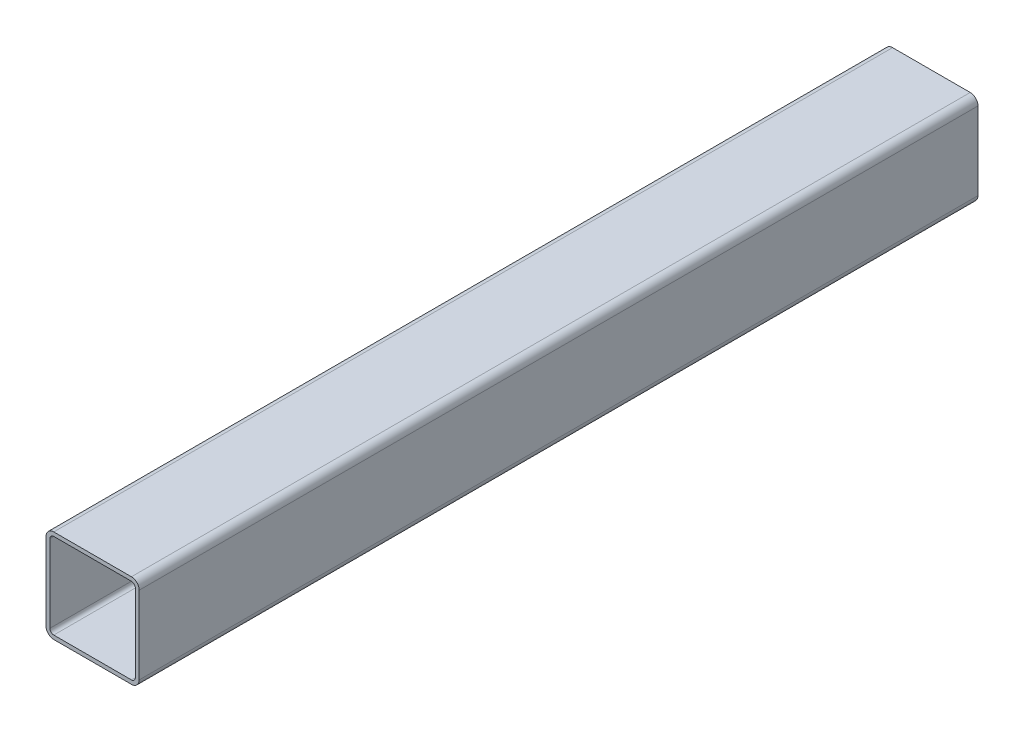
ISO-10303-21;
HEADER;
FILE_DESCRIPTION(('STEP AP214'),'2;1');
FILE_NAME('part.step','',(''),(''),'','','');
FILE_SCHEMA(('AUTOMOTIVE_DESIGN { 1 0 10303 214 1 1 1 1 }'));
ENDSEC;
DATA;
#1=APPLICATION_CONTEXT('core data for automotive mechanical design processes');
#2=APPLICATION_PROTOCOL_DEFINITION('international standard','automotive_design',2000,#1);
#3=PRODUCT_CONTEXT('',#1,'mechanical');
#4=PRODUCT('Part','Part','',(#3));
#5=PRODUCT_RELATED_PRODUCT_CATEGORY('part','',(#4));
#6=PRODUCT_DEFINITION_FORMATION('','',#4);
#7=PRODUCT_DEFINITION_CONTEXT('part definition',#1,'design');
#8=PRODUCT_DEFINITION('design','',#6,#7);
#9=PRODUCT_DEFINITION_SHAPE('','',#8);
#10=(LENGTH_UNIT() NAMED_UNIT(*) SI_UNIT(.MILLI.,.METRE.));
#11=(NAMED_UNIT(*) PLANE_ANGLE_UNIT() SI_UNIT($,.RADIAN.));
#12=(NAMED_UNIT(*) SI_UNIT($,.STERADIAN.) SOLID_ANGLE_UNIT());
#13=UNCERTAINTY_MEASURE_WITH_UNIT(LENGTH_MEASURE(1.E-05),#10,'distance_accuracy_value','');
#14=(GEOMETRIC_REPRESENTATION_CONTEXT(3) GLOBAL_UNCERTAINTY_ASSIGNED_CONTEXT((#13)) GLOBAL_UNIT_ASSIGNED_CONTEXT((#10,
#11,#12)) REPRESENTATION_CONTEXT('',''));
#15=CARTESIAN_POINT('',(0.,0.,0.));
#16=DIRECTION('',(0.,0.,1.));
#17=DIRECTION('',(1.,0.,0.));
#18=AXIS2_PLACEMENT_3D('',#15,#16,#17);
#19=CARTESIAN_POINT('',(-63.5,63.5,-1219.2));
#20=DIRECTION('',(0.,0.,1.));
#21=DIRECTION('',(1.,0.,0.));
#22=AXIS2_PLACEMENT_3D('',#19,#20,#21);
#23=CYLINDRICAL_SURFACE('',#22,12.7);
#24=DIRECTION('',(0.,0.,1.));
#25=VECTOR('',#24,1.);
#26=CARTESIAN_POINT('',(-76.2,63.5,-1219.2));
#27=LINE('',#26,#25);
#28=CARTESIAN_POINT('',(-76.2,63.5,-1219.2));
#29=VERTEX_POINT('',#28);
#30=CARTESIAN_POINT('',(-76.2,63.5,152.4));
#31=VERTEX_POINT('',#30);
#32=EDGE_CURVE('E48',#29,#31,#27,.T.);
#33=ORIENTED_EDGE('',*,*,#32,.T.);
#34=CARTESIAN_POINT('',(-63.5,63.5,152.4));
#35=DIRECTION('',(0.,0.,1.));
#36=DIRECTION('',(1.,0.,0.));
#37=AXIS2_PLACEMENT_3D('',#34,#35,#36);
#38=CIRCLE('',#37,12.7);
#39=CARTESIAN_POINT('',(-63.5,76.2,152.4));
#40=VERTEX_POINT('',#39);
#41=EDGE_CURVE('E211',#40,#31,#38,.T.);
#42=ORIENTED_EDGE('',*,*,#41,.F.);
#43=DIRECTION('',(0.,0.,1.));
#44=VECTOR('',#43,1.);
#45=CARTESIAN_POINT('',(-63.5,76.2,-1219.2));
#46=LINE('',#45,#44);
#47=CARTESIAN_POINT('',(-63.5,76.2,-1219.2));
#48=VERTEX_POINT('',#47);
#49=EDGE_CURVE('E11',#48,#40,#46,.T.);
#50=ORIENTED_EDGE('',*,*,#49,.F.);
#51=CARTESIAN_POINT('',(-63.5,63.5,-1219.2));
#52=DIRECTION('',(0.,0.,1.));
#53=DIRECTION('',(1.,0.,0.));
#54=AXIS2_PLACEMENT_3D('',#51,#52,#53);
#55=CIRCLE('',#54,12.7);
#56=EDGE_CURVE('E271',#48,#29,#55,.T.);
#57=ORIENTED_EDGE('',*,*,#56,.T.);
#58=EDGE_LOOP('',(#33,#42,#50,#57));
#59=FACE_BOUND('',#58,.T.);
#60=ADVANCED_FACE('F45',(#59),#23,.T.);
#61=CARTESIAN_POINT('',(-63.5,76.2,-1219.2));
#62=DIRECTION('',(0.,1.,0.));
#63=DIRECTION('',(0.,0.,1.));
#64=AXIS2_PLACEMENT_3D('',#61,#62,#63);
#65=PLANE('',#64);
#66=ORIENTED_EDGE('',*,*,#49,.T.);
#67=DIRECTION('',(-1.,0.,0.));
#68=VECTOR('',#67,1.);
#69=CARTESIAN_POINT('',(-63.5,76.2,152.4));
#70=LINE('',#69,#68);
#71=CARTESIAN_POINT('',(63.5,76.2,152.4));
#72=VERTEX_POINT('',#71);
#73=EDGE_CURVE('E239',#72,#40,#70,.T.);
#74=ORIENTED_EDGE('',*,*,#73,.F.);
#75=DIRECTION('',(0.,0.,1.));
#76=VECTOR('',#75,1.);
#77=CARTESIAN_POINT('',(63.5,76.2,-1219.2));
#78=LINE('',#77,#76);
#79=CARTESIAN_POINT('',(63.5,76.2,-1219.2));
#80=VERTEX_POINT('',#79);
#81=EDGE_CURVE('E54',#80,#72,#78,.T.);
#82=ORIENTED_EDGE('',*,*,#81,.F.);
#83=DIRECTION('',(-1.,0.,0.));
#84=VECTOR('',#83,1.);
#85=CARTESIAN_POINT('',(-63.5,76.2,-1219.2));
#86=LINE('',#85,#84);
#87=EDGE_CURVE('E315',#80,#48,#86,.T.);
#88=ORIENTED_EDGE('',*,*,#87,.T.);
#89=EDGE_LOOP('',(#66,#74,#82,#88));
#90=FACE_BOUND('',#89,.T.);
#91=ADVANCED_FACE('F344',(#90),#65,.T.);
#92=CARTESIAN_POINT('',(63.5,63.5,-1219.2));
#93=DIRECTION('',(0.,0.,1.));
#94=DIRECTION('',(1.,0.,0.));
#95=AXIS2_PLACEMENT_3D('',#92,#93,#94);
#96=CYLINDRICAL_SURFACE('',#95,12.7);
#97=ORIENTED_EDGE('',*,*,#81,.T.);
#98=CARTESIAN_POINT('',(63.5,63.5,152.4));
#99=DIRECTION('',(0.,0.,1.));
#100=DIRECTION('',(1.,0.,0.));
#101=AXIS2_PLACEMENT_3D('',#98,#99,#100);
#102=CIRCLE('',#101,12.7);
#103=CARTESIAN_POINT('',(76.2,63.5,152.4));
#104=VERTEX_POINT('',#103);
#105=EDGE_CURVE('E235',#104,#72,#102,.T.);
#106=ORIENTED_EDGE('',*,*,#105,.F.);
#107=DIRECTION('',(0.,0.,1.));
#108=VECTOR('',#107,1.);
#109=CARTESIAN_POINT('',(76.2,63.5,-1219.2));
#110=LINE('',#109,#108);
#111=CARTESIAN_POINT('',(76.2,63.5,-1219.2));
#112=VERTEX_POINT('',#111);
#113=EDGE_CURVE('E321',#112,#104,#110,.T.);
#114=ORIENTED_EDGE('',*,*,#113,.F.);
#115=CARTESIAN_POINT('',(63.5,63.5,-1219.2));
#116=DIRECTION('',(0.,0.,1.));
#117=DIRECTION('',(1.,0.,0.));
#118=AXIS2_PLACEMENT_3D('',#115,#116,#117);
#119=CIRCLE('',#118,12.7);
#120=EDGE_CURVE('E311',#112,#80,#119,.T.);
#121=ORIENTED_EDGE('',*,*,#120,.T.);
#122=EDGE_LOOP('',(#97,#106,#114,#121));
#123=FACE_BOUND('',#122,.T.);
#124=ADVANCED_FACE('F365',(#123),#96,.T.);
#125=CARTESIAN_POINT('',(76.2,-63.5,-1219.2));
#126=DIRECTION('',(1.,0.,0.));
#127=DIRECTION('',(0.,0.,-1.));
#128=AXIS2_PLACEMENT_3D('',#125,#126,#127);
#129=PLANE('',#128);
#130=ORIENTED_EDGE('',*,*,#113,.T.);
#131=DIRECTION('',(0.,1.,0.));
#132=VECTOR('',#131,1.);
#133=CARTESIAN_POINT('',(76.2,-63.5,152.4));
#134=LINE('',#133,#132);
#135=CARTESIAN_POINT('',(76.2,-63.5,152.4));
#136=VERTEX_POINT('',#135);
#137=EDGE_CURVE('E231',#136,#104,#134,.T.);
#138=ORIENTED_EDGE('',*,*,#137,.F.);
#139=DIRECTION('',(0.,0.,1.));
#140=VECTOR('',#139,1.);
#141=CARTESIAN_POINT('',(76.2,-63.5,-1219.2));
#142=LINE('',#141,#140);
#143=CARTESIAN_POINT('',(76.2,-63.5,-1219.2));
#144=VERTEX_POINT('',#143);
#145=EDGE_CURVE('E324',#144,#136,#142,.T.);
#146=ORIENTED_EDGE('',*,*,#145,.F.);
#147=DIRECTION('',(0.,1.,0.));
#148=VECTOR('',#147,1.);
#149=CARTESIAN_POINT('',(76.2,-63.5,-1219.2));
#150=LINE('',#149,#148);
#151=EDGE_CURVE('E307',#144,#112,#150,.T.);
#152=ORIENTED_EDGE('',*,*,#151,.T.);
#153=EDGE_LOOP('',(#130,#138,#146,#152));
#154=FACE_BOUND('',#153,.T.);
#155=ADVANCED_FACE('F362',(#154),#129,.T.);
#156=CARTESIAN_POINT('',(63.5,-63.5,-1219.2));
#157=DIRECTION('',(0.,0.,1.));
#158=DIRECTION('',(1.,0.,0.));
#159=AXIS2_PLACEMENT_3D('',#156,#157,#158);
#160=CYLINDRICAL_SURFACE('',#159,12.7);
#161=ORIENTED_EDGE('',*,*,#145,.T.);
#162=CARTESIAN_POINT('',(63.5,-63.5,152.4));
#163=DIRECTION('',(0.,0.,1.));
#164=DIRECTION('',(1.,0.,0.));
#165=AXIS2_PLACEMENT_3D('',#162,#163,#164);
#166=CIRCLE('',#165,12.7);
#167=CARTESIAN_POINT('',(63.5,-76.2,152.4));
#168=VERTEX_POINT('',#167);
#169=EDGE_CURVE('E227',#168,#136,#166,.T.);
#170=ORIENTED_EDGE('',*,*,#169,.F.);
#171=DIRECTION('',(0.,0.,1.));
#172=VECTOR('',#171,1.);
#173=CARTESIAN_POINT('',(63.5,-76.2,-1219.2));
#174=LINE('',#173,#172);
#175=CARTESIAN_POINT('',(63.5,-76.2,-1219.2));
#176=VERTEX_POINT('',#175);
#177=EDGE_CURVE('E327',#176,#168,#174,.T.);
#178=ORIENTED_EDGE('',*,*,#177,.F.);
#179=CARTESIAN_POINT('',(63.5,-63.5,-1219.2));
#180=DIRECTION('',(0.,0.,1.));
#181=DIRECTION('',(1.,0.,0.));
#182=AXIS2_PLACEMENT_3D('',#179,#180,#181);
#183=CIRCLE('',#182,12.7);
#184=EDGE_CURVE('E303',#176,#144,#183,.T.);
#185=ORIENTED_EDGE('',*,*,#184,.T.);
#186=EDGE_LOOP('',(#161,#170,#178,#185));
#187=FACE_BOUND('',#186,.T.);
#188=ADVANCED_FACE('F360',(#187),#160,.T.);
#189=CARTESIAN_POINT('',(63.5,-76.2,-1219.2));
#190=DIRECTION('',(0.,-1.,0.));
#191=DIRECTION('',(0.,0.,-1.));
#192=AXIS2_PLACEMENT_3D('',#189,#190,#191);
#193=PLANE('',#192);
#194=ORIENTED_EDGE('',*,*,#177,.T.);
#195=DIRECTION('',(1.,0.,0.));
#196=VECTOR('',#195,1.);
#197=CARTESIAN_POINT('',(63.5,-76.2,152.4));
#198=LINE('',#197,#196);
#199=CARTESIAN_POINT('',(-63.5,-76.2,152.4));
#200=VERTEX_POINT('',#199);
#201=EDGE_CURVE('E223',#200,#168,#198,.T.);
#202=ORIENTED_EDGE('',*,*,#201,.F.);
#203=DIRECTION('',(0.,0.,1.));
#204=VECTOR('',#203,1.);
#205=CARTESIAN_POINT('',(-63.5,-76.2,-1219.2));
#206=LINE('',#205,#204);
#207=CARTESIAN_POINT('',(-63.5,-76.2,-1219.2));
#208=VERTEX_POINT('',#207);
#209=EDGE_CURVE('E330',#208,#200,#206,.T.);
#210=ORIENTED_EDGE('',*,*,#209,.F.);
#211=DIRECTION('',(1.,0.,0.));
#212=VECTOR('',#211,1.);
#213=CARTESIAN_POINT('',(63.5,-76.2,-1219.2));
#214=LINE('',#213,#212);
#215=EDGE_CURVE('E299',#208,#176,#214,.T.);
#216=ORIENTED_EDGE('',*,*,#215,.T.);
#217=EDGE_LOOP('',(#194,#202,#210,#216));
#218=FACE_BOUND('',#217,.T.);
#219=ADVANCED_FACE('F358',(#218),#193,.T.);
#220=CARTESIAN_POINT('',(-63.5,-63.5,-1219.2));
#221=DIRECTION('',(0.,0.,1.));
#222=DIRECTION('',(1.,0.,0.));
#223=AXIS2_PLACEMENT_3D('',#220,#221,#222);
#224=CYLINDRICAL_SURFACE('',#223,12.7);
#225=ORIENTED_EDGE('',*,*,#209,.T.);
#226=CARTESIAN_POINT('',(-63.5,-63.5,152.4));
#227=DIRECTION('',(0.,0.,1.));
#228=DIRECTION('',(1.,0.,0.));
#229=AXIS2_PLACEMENT_3D('',#226,#227,#228);
#230=CIRCLE('',#229,12.7);
#231=CARTESIAN_POINT('',(-76.2,-63.5,152.4));
#232=VERTEX_POINT('',#231);
#233=EDGE_CURVE('E219',#232,#200,#230,.T.);
#234=ORIENTED_EDGE('',*,*,#233,.F.);
#235=DIRECTION('',(0.,0.,1.));
#236=VECTOR('',#235,1.);
#237=CARTESIAN_POINT('',(-76.2,-63.5,-1219.2));
#238=LINE('',#237,#236);
#239=CARTESIAN_POINT('',(-76.2,-63.5,-1219.2));
#240=VERTEX_POINT('',#239);
#241=EDGE_CURVE('E332',#240,#232,#238,.T.);
#242=ORIENTED_EDGE('',*,*,#241,.F.);
#243=CARTESIAN_POINT('',(-63.5,-63.5,-1219.2));
#244=DIRECTION('',(0.,0.,1.));
#245=DIRECTION('',(1.,0.,0.));
#246=AXIS2_PLACEMENT_3D('',#243,#244,#245);
#247=CIRCLE('',#246,12.7);
#248=EDGE_CURVE('E295',#240,#208,#247,.T.);
#249=ORIENTED_EDGE('',*,*,#248,.T.);
#250=EDGE_LOOP('',(#225,#234,#242,#249));
#251=FACE_BOUND('',#250,.T.);
#252=ADVANCED_FACE('F354',(#251),#224,.T.);
#253=CARTESIAN_POINT('',(-76.2,63.5,-1219.2));
#254=DIRECTION('',(-1.,0.,0.));
#255=DIRECTION('',(0.,-1.,0.));
#256=AXIS2_PLACEMENT_3D('',#253,#254,#255);
#257=PLANE('',#256);
#258=ORIENTED_EDGE('',*,*,#241,.T.);
#259=DIRECTION('',(0.,-1.,0.));
#260=VECTOR('',#259,1.);
#261=CARTESIAN_POINT('',(-76.2,63.5,152.4));
#262=LINE('',#261,#260);
#263=EDGE_CURVE('E215',#31,#232,#262,.T.);
#264=ORIENTED_EDGE('',*,*,#263,.F.);
#265=ORIENTED_EDGE('',*,*,#32,.F.);
#266=DIRECTION('',(0.,-1.,0.));
#267=VECTOR('',#266,1.);
#268=CARTESIAN_POINT('',(-76.2,63.5,-1219.2));
#269=LINE('',#268,#267);
#270=EDGE_CURVE('E291',#29,#240,#269,.T.);
#271=ORIENTED_EDGE('',*,*,#270,.T.);
#272=EDGE_LOOP('',(#258,#264,#265,#271));
#273=FACE_BOUND('',#272,.T.);
#274=ADVANCED_FACE('F338',(#273),#257,.T.);
#275=CARTESIAN_POINT('',(-63.5,63.5,-1219.2));
#276=DIRECTION('',(0.,0.,1.));
#277=DIRECTION('',(1.,0.,0.));
#278=AXIS2_PLACEMENT_3D('',#275,#276,#277);
#279=PLANE('',#278);
#280=DIRECTION('',(-1.,0.,0.));
#281=VECTOR('',#280,1.);
#282=CARTESIAN_POINT('',(-63.5,69.85,-1219.2));
#283=LINE('',#282,#281);
#284=CARTESIAN_POINT('',(63.5,69.85,-1219.2));
#285=VERTEX_POINT('',#284);
#286=CARTESIAN_POINT('',(-63.5,69.85,-1219.2));
#287=VERTEX_POINT('',#286);
#288=EDGE_CURVE('E172',#285,#287,#283,.T.);
#289=ORIENTED_EDGE('',*,*,#288,.T.);
#290=CARTESIAN_POINT('',(-63.5,63.5,-1219.2));
#291=DIRECTION('',(0.,0.,1.));
#292=DIRECTION('',(1.,0.,0.));
#293=AXIS2_PLACEMENT_3D('',#290,#291,#292);
#294=CIRCLE('',#293,6.35000000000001);
#295=CARTESIAN_POINT('',(-69.85,63.5,-1219.2));
#296=VERTEX_POINT('',#295);
#297=EDGE_CURVE('E243',#287,#296,#294,.T.);
#298=ORIENTED_EDGE('',*,*,#297,.T.);
#299=DIRECTION('',(0.,-1.,0.));
#300=VECTOR('',#299,1.);
#301=CARTESIAN_POINT('',(-69.85,63.5,-1219.2));
#302=LINE('',#301,#300);
#303=CARTESIAN_POINT('',(-69.85,-63.5,-1219.2));
#304=VERTEX_POINT('',#303);
#305=EDGE_CURVE('E166',#296,#304,#302,.T.);
#306=ORIENTED_EDGE('',*,*,#305,.T.);
#307=CARTESIAN_POINT('',(-63.5,-63.5,-1219.2));
#308=DIRECTION('',(0.,0.,1.));
#309=DIRECTION('',(1.,0.,0.));
#310=AXIS2_PLACEMENT_3D('',#307,#308,#309);
#311=CIRCLE('',#310,6.34999999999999);
#312=CARTESIAN_POINT('',(-63.5,-69.85,-1219.2));
#313=VERTEX_POINT('',#312);
#314=EDGE_CURVE('E62',#304,#313,#311,.T.);
#315=ORIENTED_EDGE('',*,*,#314,.T.);
#316=DIRECTION('',(1.,0.,0.));
#317=VECTOR('',#316,1.);
#318=CARTESIAN_POINT('',(63.5,-69.85,-1219.2));
#319=LINE('',#318,#317);
#320=CARTESIAN_POINT('',(63.5,-69.85,-1219.2));
#321=VERTEX_POINT('',#320);
#322=EDGE_CURVE('E250',#313,#321,#319,.T.);
#323=ORIENTED_EDGE('',*,*,#322,.T.);
#324=CARTESIAN_POINT('',(63.5,-63.5,-1219.2));
#325=DIRECTION('',(0.,0.,1.));
#326=DIRECTION('',(1.,0.,0.));
#327=AXIS2_PLACEMENT_3D('',#324,#325,#326);
#328=CIRCLE('',#327,6.35);
#329=CARTESIAN_POINT('',(69.85,-63.5,-1219.2));
#330=VERTEX_POINT('',#329);
#331=EDGE_CURVE('E254',#321,#330,#328,.T.);
#332=ORIENTED_EDGE('',*,*,#331,.T.);
#333=DIRECTION('',(0.,1.,0.));
#334=VECTOR('',#333,1.);
#335=CARTESIAN_POINT('',(69.85,-63.5,-1219.2));
#336=LINE('',#335,#334);
#337=CARTESIAN_POINT('',(69.85,63.5,-1219.2));
#338=VERTEX_POINT('',#337);
#339=EDGE_CURVE('E258',#330,#338,#336,.T.);
#340=ORIENTED_EDGE('',*,*,#339,.T.);
#341=CARTESIAN_POINT('',(63.5,63.5,-1219.2));
#342=DIRECTION('',(0.,0.,1.));
#343=DIRECTION('',(1.,0.,0.));
#344=AXIS2_PLACEMENT_3D('',#341,#342,#343);
#345=CIRCLE('',#344,6.34999999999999);
#346=EDGE_CURVE('E262',#338,#285,#345,.T.);
#347=ORIENTED_EDGE('',*,*,#346,.T.);
#348=EDGE_LOOP('',(#289,#298,#306,#315,#323,#332,#340,#347));
#349=FACE_BOUND('',#348,.T.);
#350=ORIENTED_EDGE('',*,*,#56,.F.);
#351=ORIENTED_EDGE('',*,*,#87,.F.);
#352=ORIENTED_EDGE('',*,*,#120,.F.);
#353=ORIENTED_EDGE('',*,*,#151,.F.);
#354=ORIENTED_EDGE('',*,*,#184,.F.);
#355=ORIENTED_EDGE('',*,*,#215,.F.);
#356=ORIENTED_EDGE('',*,*,#248,.F.);
#357=ORIENTED_EDGE('',*,*,#270,.F.);
#358=EDGE_LOOP('',(#350,#351,#352,#353,#354,#355,#356,#357));
#359=FACE_BOUND('',#358,.T.);
#360=ADVANCED_FACE('F348',(#349,#359),#279,.F.);
#361=CARTESIAN_POINT('',(-63.5,63.5,-1219.2));
#362=DIRECTION('',(0.,0.,1.));
#363=DIRECTION('',(1.,0.,0.));
#364=AXIS2_PLACEMENT_3D('',#361,#362,#363);
#365=CYLINDRICAL_SURFACE('',#364,6.35000000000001);
#366=DIRECTION('',(0.,0.,1.));
#367=VECTOR('',#366,1.);
#368=CARTESIAN_POINT('',(-63.5,69.85,-1219.2));
#369=LINE('',#368,#367);
#370=CARTESIAN_POINT('',(-63.5,69.85,152.4));
#371=VERTEX_POINT('',#370);
#372=EDGE_CURVE('E177',#287,#371,#369,.T.);
#373=ORIENTED_EDGE('',*,*,#372,.T.);
#374=CARTESIAN_POINT('',(-63.5,63.5,152.4));
#375=DIRECTION('',(0.,0.,1.));
#376=DIRECTION('',(1.,0.,0.));
#377=AXIS2_PLACEMENT_3D('',#374,#375,#376);
#378=CIRCLE('',#377,6.35000000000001);
#379=CARTESIAN_POINT('',(-69.85,63.5,152.4));
#380=VERTEX_POINT('',#379);
#381=EDGE_CURVE('E175',#371,#380,#378,.T.);
#382=ORIENTED_EDGE('',*,*,#381,.T.);
#383=DIRECTION('',(0.,0.,1.));
#384=VECTOR('',#383,1.);
#385=CARTESIAN_POINT('',(-69.85,63.5,-1219.2));
#386=LINE('',#385,#384);
#387=EDGE_CURVE('E159',#296,#380,#386,.T.);
#388=ORIENTED_EDGE('',*,*,#387,.F.);
#389=ORIENTED_EDGE('',*,*,#297,.F.);
#390=EDGE_LOOP('',(#373,#382,#388,#389));
#391=FACE_BOUND('',#390,.T.);
#392=ADVANCED_FACE('F176',(#391),#365,.F.);
#393=CARTESIAN_POINT('',(-63.5,69.85,-1219.2));
#394=DIRECTION('',(0.,1.,0.));
#395=DIRECTION('',(0.,0.,1.));
#396=AXIS2_PLACEMENT_3D('',#393,#394,#395);
#397=PLANE('',#396);
#398=DIRECTION('',(0.,0.,1.));
#399=VECTOR('',#398,1.);
#400=CARTESIAN_POINT('',(63.5,69.85,-1219.2));
#401=LINE('',#400,#399);
#402=CARTESIAN_POINT('',(63.5,69.85,152.4));
#403=VERTEX_POINT('',#402);
#404=EDGE_CURVE('E272',#285,#403,#401,.T.);
#405=ORIENTED_EDGE('',*,*,#404,.T.);
#406=DIRECTION('',(-1.,0.,0.));
#407=VECTOR('',#406,1.);
#408=CARTESIAN_POINT('',(-63.5,69.85,152.4));
#409=LINE('',#408,#407);
#410=EDGE_CURVE('E208',#403,#371,#409,.T.);
#411=ORIENTED_EDGE('',*,*,#410,.T.);
#412=ORIENTED_EDGE('',*,*,#372,.F.);
#413=ORIENTED_EDGE('',*,*,#288,.F.);
#414=EDGE_LOOP('',(#405,#411,#412,#413));
#415=FACE_BOUND('',#414,.T.);
#416=ADVANCED_FACE('F442',(#415),#397,.F.);
#417=CARTESIAN_POINT('',(63.5,63.5,-1219.2));
#418=DIRECTION('',(0.,0.,1.));
#419=DIRECTION('',(1.,0.,0.));
#420=AXIS2_PLACEMENT_3D('',#417,#418,#419);
#421=CYLINDRICAL_SURFACE('',#420,6.34999999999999);
#422=DIRECTION('',(0.,0.,1.));
#423=VECTOR('',#422,1.);
#424=CARTESIAN_POINT('',(69.85,63.5,-1219.2));
#425=LINE('',#424,#423);
#426=CARTESIAN_POINT('',(69.85,63.5,152.4));
#427=VERTEX_POINT('',#426);
#428=EDGE_CURVE('E275',#338,#427,#425,.T.);
#429=ORIENTED_EDGE('',*,*,#428,.T.);
#430=CARTESIAN_POINT('',(63.5,63.5,152.4));
#431=DIRECTION('',(0.,0.,1.));
#432=DIRECTION('',(1.,0.,0.));
#433=AXIS2_PLACEMENT_3D('',#430,#431,#432);
#434=CIRCLE('',#433,6.34999999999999);
#435=EDGE_CURVE('E204',#427,#403,#434,.T.);
#436=ORIENTED_EDGE('',*,*,#435,.T.);
#437=ORIENTED_EDGE('',*,*,#404,.F.);
#438=ORIENTED_EDGE('',*,*,#346,.F.);
#439=EDGE_LOOP('',(#429,#436,#437,#438));
#440=FACE_BOUND('',#439,.T.);
#441=ADVANCED_FACE('F451',(#440),#421,.F.);
#442=CARTESIAN_POINT('',(69.85,-63.5,-1219.2));
#443=DIRECTION('',(1.,0.,0.));
#444=DIRECTION('',(0.,1.,0.));
#445=AXIS2_PLACEMENT_3D('',#442,#443,#444);
#446=PLANE('',#445);
#447=DIRECTION('',(0.,0.,1.));
#448=VECTOR('',#447,1.);
#449=CARTESIAN_POINT('',(69.85,-63.5,-1219.2));
#450=LINE('',#449,#448);
#451=CARTESIAN_POINT('',(69.85,-63.5,152.4));
#452=VERTEX_POINT('',#451);
#453=EDGE_CURVE('E278',#330,#452,#450,.T.);
#454=ORIENTED_EDGE('',*,*,#453,.T.);
#455=DIRECTION('',(0.,1.,0.));
#456=VECTOR('',#455,1.);
#457=CARTESIAN_POINT('',(69.85,-63.5,152.4));
#458=LINE('',#457,#456);
#459=EDGE_CURVE('E200',#452,#427,#458,.T.);
#460=ORIENTED_EDGE('',*,*,#459,.T.);
#461=ORIENTED_EDGE('',*,*,#428,.F.);
#462=ORIENTED_EDGE('',*,*,#339,.F.);
#463=EDGE_LOOP('',(#454,#460,#461,#462));
#464=FACE_BOUND('',#463,.T.);
#465=ADVANCED_FACE('F461',(#464),#446,.F.);
#466=CARTESIAN_POINT('',(63.5,-63.5,-1219.2));
#467=DIRECTION('',(0.,0.,1.));
#468=DIRECTION('',(1.,0.,0.));
#469=AXIS2_PLACEMENT_3D('',#466,#467,#468);
#470=CYLINDRICAL_SURFACE('',#469,6.35);
#471=DIRECTION('',(0.,0.,1.));
#472=VECTOR('',#471,1.);
#473=CARTESIAN_POINT('',(63.5,-69.85,-1219.2));
#474=LINE('',#473,#472);
#475=CARTESIAN_POINT('',(63.5,-69.85,152.4));
#476=VERTEX_POINT('',#475);
#477=EDGE_CURVE('E281',#321,#476,#474,.T.);
#478=ORIENTED_EDGE('',*,*,#477,.T.);
#479=CARTESIAN_POINT('',(63.5,-63.5,152.4));
#480=DIRECTION('',(0.,0.,1.));
#481=DIRECTION('',(1.,0.,0.));
#482=AXIS2_PLACEMENT_3D('',#479,#480,#481);
#483=CIRCLE('',#482,6.35);
#484=EDGE_CURVE('E196',#476,#452,#483,.T.);
#485=ORIENTED_EDGE('',*,*,#484,.T.);
#486=ORIENTED_EDGE('',*,*,#453,.F.);
#487=ORIENTED_EDGE('',*,*,#331,.F.);
#488=EDGE_LOOP('',(#478,#485,#486,#487));
#489=FACE_BOUND('',#488,.T.);
#490=ADVANCED_FACE('F471',(#489),#470,.F.);
#491=CARTESIAN_POINT('',(63.5,-69.85,-1219.2));
#492=DIRECTION('',(0.,-1.,0.));
#493=DIRECTION('',(0.,0.,-1.));
#494=AXIS2_PLACEMENT_3D('',#491,#492,#493);
#495=PLANE('',#494);
#496=DIRECTION('',(0.,0.,1.));
#497=VECTOR('',#496,1.);
#498=CARTESIAN_POINT('',(-63.5,-69.85,-1219.2));
#499=LINE('',#498,#497);
#500=CARTESIAN_POINT('',(-63.5,-69.85,152.4));
#501=VERTEX_POINT('',#500);
#502=EDGE_CURVE('E284',#313,#501,#499,.T.);
#503=ORIENTED_EDGE('',*,*,#502,.T.);
#504=DIRECTION('',(1.,0.,0.));
#505=VECTOR('',#504,1.);
#506=CARTESIAN_POINT('',(63.5,-69.85,152.4));
#507=LINE('',#506,#505);
#508=EDGE_CURVE('E190',#501,#476,#507,.T.);
#509=ORIENTED_EDGE('',*,*,#508,.T.);
#510=ORIENTED_EDGE('',*,*,#477,.F.);
#511=ORIENTED_EDGE('',*,*,#322,.F.);
#512=EDGE_LOOP('',(#503,#509,#510,#511));
#513=FACE_BOUND('',#512,.T.);
#514=ADVANCED_FACE('F481',(#513),#495,.F.);
#515=CARTESIAN_POINT('',(-63.5,-63.5,-1219.2));
#516=DIRECTION('',(0.,0.,1.));
#517=DIRECTION('',(1.,0.,0.));
#518=AXIS2_PLACEMENT_3D('',#515,#516,#517);
#519=CYLINDRICAL_SURFACE('',#518,6.34999999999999);
#520=DIRECTION('',(0.,0.,1.));
#521=VECTOR('',#520,1.);
#522=CARTESIAN_POINT('',(-69.85,-63.5,-1219.2));
#523=LINE('',#522,#521);
#524=CARTESIAN_POINT('',(-69.85,-63.5,152.4));
#525=VERTEX_POINT('',#524);
#526=EDGE_CURVE('E171',#304,#525,#523,.T.);
#527=ORIENTED_EDGE('',*,*,#526,.T.);
#528=CARTESIAN_POINT('',(-63.5,-63.5,152.4));
#529=DIRECTION('',(0.,0.,1.));
#530=DIRECTION('',(1.,0.,0.));
#531=AXIS2_PLACEMENT_3D('',#528,#529,#530);
#532=CIRCLE('',#531,6.34999999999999);
#533=EDGE_CURVE('E186',#525,#501,#532,.T.);
#534=ORIENTED_EDGE('',*,*,#533,.T.);
#535=ORIENTED_EDGE('',*,*,#502,.F.);
#536=ORIENTED_EDGE('',*,*,#314,.F.);
#537=EDGE_LOOP('',(#527,#534,#535,#536));
#538=FACE_BOUND('',#537,.T.);
#539=ADVANCED_FACE('F491',(#538),#519,.F.);
#540=CARTESIAN_POINT('',(-69.85,63.5,-1219.2));
#541=DIRECTION('',(-1.,0.,0.));
#542=DIRECTION('',(0.,-1.,0.));
#543=AXIS2_PLACEMENT_3D('',#540,#541,#542);
#544=PLANE('',#543);
#545=ORIENTED_EDGE('',*,*,#387,.T.);
#546=DIRECTION('',(0.,-1.,0.));
#547=VECTOR('',#546,1.);
#548=CARTESIAN_POINT('',(-69.85,63.5,152.4));
#549=LINE('',#548,#547);
#550=EDGE_CURVE('E163',#380,#525,#549,.T.);
#551=ORIENTED_EDGE('',*,*,#550,.T.);
#552=ORIENTED_EDGE('',*,*,#526,.F.);
#553=ORIENTED_EDGE('',*,*,#305,.F.);
#554=EDGE_LOOP('',(#545,#551,#552,#553));
#555=FACE_BOUND('',#554,.T.);
#556=ADVANCED_FACE('F161',(#555),#544,.F.);
#557=CARTESIAN_POINT('',(-63.5,63.5,152.4));
#558=DIRECTION('',(0.,0.,1.));
#559=DIRECTION('',(1.,0.,0.));
#560=AXIS2_PLACEMENT_3D('',#557,#558,#559);
#561=PLANE('',#560);
#562=ORIENTED_EDGE('',*,*,#41,.T.);
#563=ORIENTED_EDGE('',*,*,#263,.T.);
#564=ORIENTED_EDGE('',*,*,#233,.T.);
#565=ORIENTED_EDGE('',*,*,#201,.T.);
#566=ORIENTED_EDGE('',*,*,#169,.T.);
#567=ORIENTED_EDGE('',*,*,#137,.T.);
#568=ORIENTED_EDGE('',*,*,#105,.T.);
#569=ORIENTED_EDGE('',*,*,#73,.T.);
#570=EDGE_LOOP('',(#562,#563,#564,#565,#566,#567,#568,#569));
#571=FACE_BOUND('',#570,.T.);
#572=ORIENTED_EDGE('',*,*,#550,.F.);
#573=ORIENTED_EDGE('',*,*,#381,.F.);
#574=ORIENTED_EDGE('',*,*,#410,.F.);
#575=ORIENTED_EDGE('',*,*,#435,.F.);
#576=ORIENTED_EDGE('',*,*,#459,.F.);
#577=ORIENTED_EDGE('',*,*,#484,.F.);
#578=ORIENTED_EDGE('',*,*,#508,.F.);
#579=ORIENTED_EDGE('',*,*,#533,.F.);
#580=EDGE_LOOP('',(#572,#573,#574,#575,#576,#577,#578,#579));
#581=FACE_BOUND('',#580,.T.);
#582=ADVANCED_FACE('F183',(#571,#581),#561,.T.);
#583=CLOSED_SHELL('',(#60,#91,#124,#155,#188,#219,#252,#274,#360,#392,#416,#441,#465,#490,#514,
#539,#556,#582));
#584=MANIFOLD_SOLID_BREP('B2',#583);
#585=ADVANCED_BREP_SHAPE_REPRESENTATION('',(#18,#584),#14);
#586=SHAPE_DEFINITION_REPRESENTATION(#9,#585);
ENDSEC;
END-ISO-10303-21;
